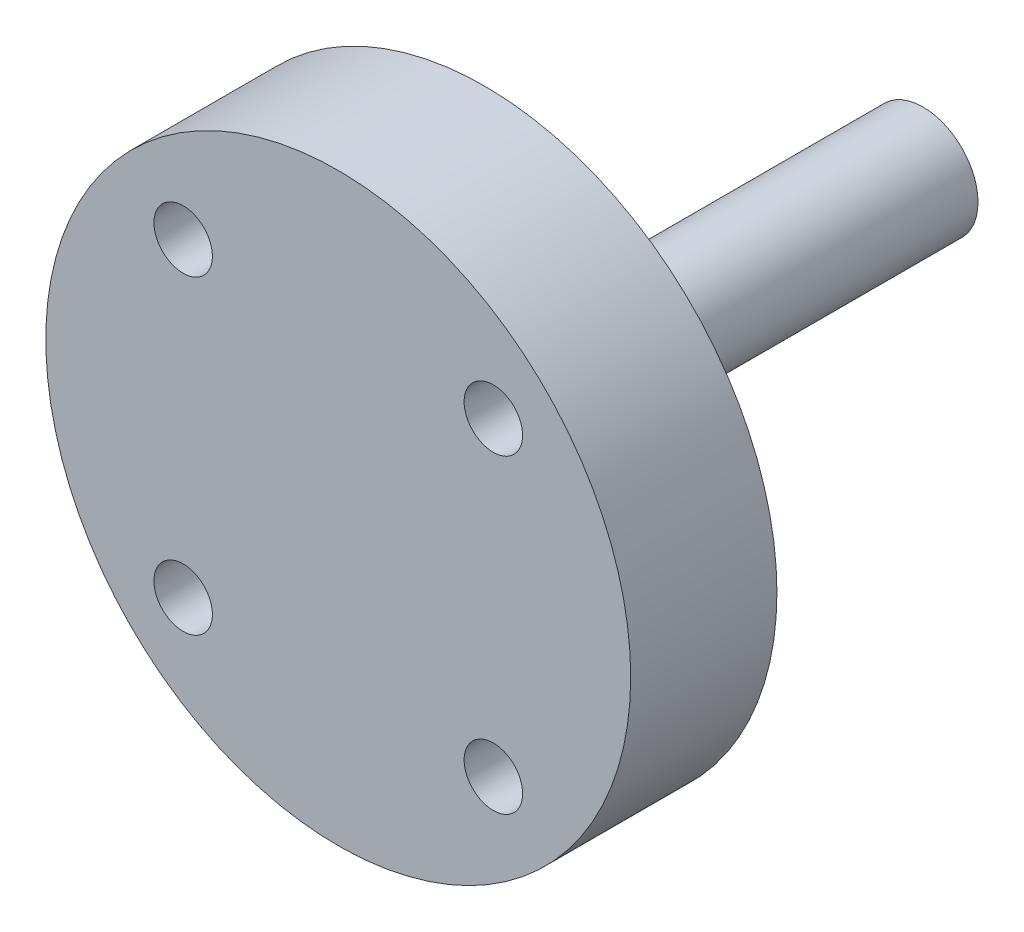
from build123d import *

# Parameters (mm, degrees)
ESQUISSE2_R                  = 7.5
BASE_EXTRUSION_DEPTH         = 60
ESQUISSE4_R                  = 40
BOSS_EXTRU_2_DEPTH           = 20
ESQUISSE5_R                  = 4
ENL_V_MAT_EXTRU_1_DEPTH      = 98.979589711
R_P_TITION_CIRCULAIRE1_COUNT = 4


with BuildPart() as part:
    # Esquisse2 → Base-Extrusion (new body)
    with BuildSketch(Plane.XY):
        Circle(ESQUISSE2_R)
    extrude(amount=BASE_EXTRUSION_DEPTH)

    # Esquisse4 → Boss.-Extru.2 (add)
    with BuildSketch(Plane.XY.offset(60)):
        Circle(ESQUISSE4_R)
    extrude(amount=BOSS_EXTRU_2_DEPTH)

    # Esquisse5 → Enl_v. mat.-Extru.1 (cut, through all)
    with BuildSketch(Plane.XY.offset(80)):
        with Locations((-21.213203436, 21.213203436)):
            Circle(ESQUISSE5_R)
    enl_v_mat_extru_1 = extrude(amount=-ENL_V_MAT_EXTRU_1_DEPTH, mode=Mode.SUBTRACT)

    # R_p_tition circulaire1: Enl_v. mat.-Extru.1 ×4 about axis
    r_p_tition_circulaire1_axis = Axis((0, 0, 0), (0, 0, -1))
    for i in range(1, R_P_TITION_CIRCULAIRE1_COUNT):
        add(enl_v_mat_extru_1.rotate(r_p_tition_circulaire1_axis, i * 360 / R_P_TITION_CIRCULAIRE1_COUNT), mode=Mode.SUBTRACT)


solid = part.part
